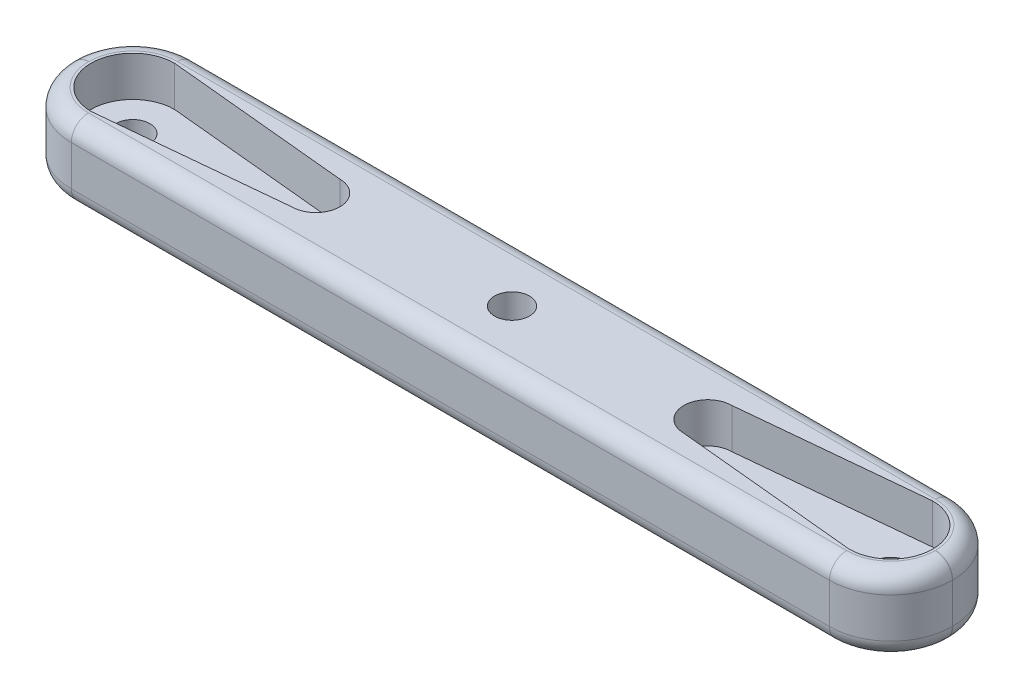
ISO-10303-21;
HEADER;
FILE_DESCRIPTION(('STEP AP214'),'2;1');
FILE_NAME('part.step','',(''),(''),'','','');
FILE_SCHEMA(('AUTOMOTIVE_DESIGN { 1 0 10303 214 1 1 1 1 }'));
ENDSEC;
DATA;
#1=APPLICATION_CONTEXT('core data for automotive mechanical design processes');
#2=APPLICATION_PROTOCOL_DEFINITION('international standard','automotive_design',2000,#1);
#3=PRODUCT_CONTEXT('',#1,'mechanical');
#4=PRODUCT('Part','Part','',(#3));
#5=PRODUCT_RELATED_PRODUCT_CATEGORY('part','',(#4));
#6=PRODUCT_DEFINITION_FORMATION('','',#4);
#7=PRODUCT_DEFINITION_CONTEXT('part definition',#1,'design');
#8=PRODUCT_DEFINITION('design','',#6,#7);
#9=PRODUCT_DEFINITION_SHAPE('','',#8);
#10=(LENGTH_UNIT() NAMED_UNIT(*) SI_UNIT(.MILLI.,.METRE.));
#11=(NAMED_UNIT(*) PLANE_ANGLE_UNIT() SI_UNIT($,.RADIAN.));
#12=(NAMED_UNIT(*) SI_UNIT($,.STERADIAN.) SOLID_ANGLE_UNIT());
#13=UNCERTAINTY_MEASURE_WITH_UNIT(LENGTH_MEASURE(1.E-05),#10,'distance_accuracy_value','');
#14=(GEOMETRIC_REPRESENTATION_CONTEXT(3) GLOBAL_UNCERTAINTY_ASSIGNED_CONTEXT((#13)) GLOBAL_UNIT_ASSIGNED_CONTEXT((#10,
#11,#12)) REPRESENTATION_CONTEXT('',''));
#15=CARTESIAN_POINT('',(0.,0.,0.));
#16=DIRECTION('',(0.,0.,1.));
#17=DIRECTION('',(1.,0.,0.));
#18=AXIS2_PLACEMENT_3D('',#15,#16,#17);
#19=CARTESIAN_POINT('',(0.,6.5,0.));
#20=DIRECTION('',(0.,-1.,0.));
#21=DIRECTION('',(0.,0.,-1.));
#22=AXIS2_PLACEMENT_3D('',#19,#20,#21);
#23=PLANE('',#22);
#24=DIRECTION('',(0.,0.,1.));
#25=VECTOR('',#24,1.);
#26=CARTESIAN_POINT('',(-37.,6.5,0.));
#27=LINE('',#26,#25);
#28=CARTESIAN_POINT('',(-37.,6.5,-0.0150000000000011));
#29=VERTEX_POINT('',#28);
#30=CARTESIAN_POINT('',(-37.,6.5,0.0150000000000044));
#31=VERTEX_POINT('',#30);
#32=EDGE_CURVE('E51',#29,#31,#27,.T.);
#33=ORIENTED_EDGE('',*,*,#32,.T.);
#34=CARTESIAN_POINT('',(-33.13,6.5,0.0150000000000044));
#35=DIRECTION('',(0.,-1.,0.));
#36=DIRECTION('',(0.,0.,-1.));
#37=AXIS2_PLACEMENT_3D('',#34,#35,#36);
#38=CIRCLE('',#37,3.87);
#39=CARTESIAN_POINT('',(-33.13,6.5,3.885));
#40=VERTEX_POINT('',#39);
#41=EDGE_CURVE('E345',#31,#40,#38,.F.);
#42=ORIENTED_EDGE('',*,*,#41,.T.);
#43=DIRECTION('',(1.,0.,0.));
#44=VECTOR('',#43,1.);
#45=CARTESIAN_POINT('',(0.,6.5,3.885));
#46=LINE('',#45,#44);
#47=CARTESIAN_POINT('',(33.13,6.5,3.885));
#48=VERTEX_POINT('',#47);
#49=EDGE_CURVE('E333',#40,#48,#46,.T.);
#50=ORIENTED_EDGE('',*,*,#49,.T.);
#51=CARTESIAN_POINT('',(33.13,6.5,0.0149999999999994));
#52=DIRECTION('',(0.,-1.,0.));
#53=DIRECTION('',(0.,0.,-1.));
#54=AXIS2_PLACEMENT_3D('',#51,#52,#53);
#55=CIRCLE('',#54,3.87);
#56=CARTESIAN_POINT('',(37.,6.5,0.0149999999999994));
#57=VERTEX_POINT('',#56);
#58=EDGE_CURVE('E335',#48,#57,#55,.F.);
#59=ORIENTED_EDGE('',*,*,#58,.T.);
#60=DIRECTION('',(0.,0.,-1.));
#61=VECTOR('',#60,1.);
#62=CARTESIAN_POINT('',(37.,6.5,0.));
#63=LINE('',#62,#61);
#64=CARTESIAN_POINT('',(37.,6.5,-0.0150000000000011));
#65=VERTEX_POINT('',#64);
#66=EDGE_CURVE('E337',#57,#65,#63,.T.);
#67=ORIENTED_EDGE('',*,*,#66,.T.);
#68=CARTESIAN_POINT('',(33.13,6.5,-0.0150000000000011));
#69=DIRECTION('',(0.,-1.,0.));
#70=DIRECTION('',(0.,0.,-1.));
#71=AXIS2_PLACEMENT_3D('',#68,#69,#70);
#72=CIRCLE('',#71,3.87);
#73=CARTESIAN_POINT('',(33.13,6.5,-3.885));
#74=VERTEX_POINT('',#73);
#75=EDGE_CURVE('E339',#65,#74,#72,.F.);
#76=ORIENTED_EDGE('',*,*,#75,.T.);
#77=DIRECTION('',(-1.,0.,0.));
#78=VECTOR('',#77,1.);
#79=CARTESIAN_POINT('',(0.,6.5,-3.885));
#80=LINE('',#79,#78);
#81=CARTESIAN_POINT('',(-33.13,6.5,-3.885));
#82=VERTEX_POINT('',#81);
#83=EDGE_CURVE('E341',#74,#82,#80,.T.);
#84=ORIENTED_EDGE('',*,*,#83,.T.);
#85=CARTESIAN_POINT('',(-33.13,6.5,-0.0150000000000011));
#86=DIRECTION('',(0.,-1.,0.));
#87=DIRECTION('',(0.,0.,-1.));
#88=AXIS2_PLACEMENT_3D('',#85,#86,#87);
#89=CIRCLE('',#88,3.87);
#90=EDGE_CURVE('E56',#82,#29,#89,.F.);
#91=ORIENTED_EDGE('',*,*,#90,.T.);
#92=EDGE_LOOP('',(#33,#42,#50,#59,#67,#76,#84,#91));
#93=FACE_BOUND('',#92,.T.);
#94=CARTESIAN_POINT('',(0.,6.5,0.));
#95=DIRECTION('',(0.,1.,0.));
#96=DIRECTION('',(0.,0.,1.));
#97=AXIS2_PLACEMENT_3D('',#94,#95,#96);
#98=CIRCLE('',#97,1.525);
#99=CARTESIAN_POINT('',(0.,6.5,1.525));
#100=VERTEX_POINT('',#99);
#101=EDGE_CURVE('E370',#100,#100,#98,.T.);
#102=ORIENTED_EDGE('',*,*,#101,.F.);
#103=EDGE_LOOP('',(#102));
#104=FACE_BOUND('',#103,.T.);
#105=CARTESIAN_POINT('',(-17.13,6.5,0.0150000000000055));
#106=DIRECTION('',(0.,1.,0.));
#107=DIRECTION('',(0.,0.,1.));
#108=AXIS2_PLACEMENT_3D('',#105,#106,#107);
#109=CIRCLE('',#108,2.1);
#110=CARTESIAN_POINT('',(-17.13,6.5,2.11500000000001));
#111=VERTEX_POINT('',#110);
#112=CARTESIAN_POINT('',(-17.13,6.5,-2.08499999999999));
#113=VERTEX_POINT('',#112);
#114=EDGE_CURVE('E223',#111,#113,#109,.T.);
#115=ORIENTED_EDGE('',*,*,#114,.F.);
#116=DIRECTION('',(-0.995340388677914,0.,0.0964236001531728));
#117=VECTOR('',#116,1.);
#118=CARTESIAN_POINT('',(0.0437192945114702,6.5,0.451295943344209));
#119=LINE('',#118,#117);
#120=CARTESIAN_POINT('',(-33.13,6.5,3.665));
#121=VERTEX_POINT('',#120);
#122=EDGE_CURVE('E214',#111,#121,#119,.T.);
#123=ORIENTED_EDGE('',*,*,#122,.T.);
#124=CARTESIAN_POINT('',(-33.13,6.5,0.0150000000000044));
#125=DIRECTION('',(0.,1.,0.));
#126=DIRECTION('',(0.,0.,1.));
#127=AXIS2_PLACEMENT_3D('',#124,#125,#126);
#128=CIRCLE('',#127,3.65);
#129=CARTESIAN_POINT('',(-33.13,6.5,-3.635));
#130=VERTEX_POINT('',#129);
#131=EDGE_CURVE('E208',#130,#121,#128,.T.);
#132=ORIENTED_EDGE('',*,*,#131,.F.);
#133=DIRECTION('',(0.995340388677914,0.,0.096423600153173));
#134=VECTOR('',#133,1.);
#135=CARTESIAN_POINT('',(0.0408400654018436,6.5,-0.421574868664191));
#136=LINE('',#135,#134);
#137=EDGE_CURVE('E261',#130,#113,#136,.T.);
#138=ORIENTED_EDGE('',*,*,#137,.T.);
#139=EDGE_LOOP('',(#115,#123,#132,#138));
#140=FACE_BOUND('',#139,.T.);
#141=CARTESIAN_POINT('',(17.13,6.5,0.0150000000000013));
#142=DIRECTION('',(0.,1.,0.));
#143=DIRECTION('',(0.,0.,1.));
#144=AXIS2_PLACEMENT_3D('',#141,#142,#143);
#145=CIRCLE('',#144,2.1);
#146=CARTESIAN_POINT('',(17.13,6.5,-2.085));
#147=VERTEX_POINT('',#146);
#148=CARTESIAN_POINT('',(17.13,6.5,2.115));
#149=VERTEX_POINT('',#148);
#150=EDGE_CURVE('E237',#147,#149,#145,.T.);
#151=ORIENTED_EDGE('',*,*,#150,.F.);
#152=DIRECTION('',(0.995340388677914,0.,-0.0964236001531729));
#153=VECTOR('',#152,1.);
#154=CARTESIAN_POINT('',(-0.0408400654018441,6.5,-0.421574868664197));
#155=LINE('',#154,#153);
#156=CARTESIAN_POINT('',(33.13,6.5,-3.635));
#157=VERTEX_POINT('',#156);
#158=EDGE_CURVE('E255',#147,#157,#155,.T.);
#159=ORIENTED_EDGE('',*,*,#158,.T.);
#160=CARTESIAN_POINT('',(33.13,6.5,0.0149999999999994));
#161=DIRECTION('',(0.,1.,0.));
#162=DIRECTION('',(0.,0.,1.));
#163=AXIS2_PLACEMENT_3D('',#160,#161,#162);
#164=CIRCLE('',#163,3.65);
#165=CARTESIAN_POINT('',(33.13,6.5,3.665));
#166=VERTEX_POINT('',#165);
#167=EDGE_CURVE('E273',#166,#157,#164,.T.);
#168=ORIENTED_EDGE('',*,*,#167,.F.);
#169=DIRECTION('',(-0.995340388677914,0.,-0.0964236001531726));
#170=VECTOR('',#169,1.);
#171=CARTESIAN_POINT('',(-0.0437192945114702,6.5,0.45129594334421));
#172=LINE('',#171,#170);
#173=EDGE_CURVE('E281',#166,#149,#172,.T.);
#174=ORIENTED_EDGE('',*,*,#173,.T.);
#175=EDGE_LOOP('',(#151,#159,#168,#174));
#176=FACE_BOUND('',#175,.T.);
#177=ADVANCED_FACE('F34',(#93,#104,#140,#176),#23,.F.);
#178=CARTESIAN_POINT('',(-38.5,6.5,-5.385));
#179=DIRECTION('',(0.,0.,1.));
#180=DIRECTION('',(1.,0.,0.));
#181=AXIS2_PLACEMENT_3D('',#178,#179,#180);
#182=PLANE('',#181);
#183=DIRECTION('',(0.,1.,0.));
#184=VECTOR('',#183,1.);
#185=CARTESIAN_POINT('',(33.13,0.,-5.385));
#186=LINE('',#185,#184);
#187=CARTESIAN_POINT('',(33.13,1.5,-5.385));
#188=VERTEX_POINT('',#187);
#189=CARTESIAN_POINT('',(33.13,5.,-5.385));
#190=VERTEX_POINT('',#189);
#191=EDGE_CURVE('E410',#188,#190,#186,.T.);
#192=ORIENTED_EDGE('',*,*,#191,.F.);
#193=DIRECTION('',(-1.,0.,0.));
#194=VECTOR('',#193,1.);
#195=CARTESIAN_POINT('',(-33.13,1.5,-5.385));
#196=LINE('',#195,#194);
#197=CARTESIAN_POINT('',(-33.13,1.5,-5.385));
#198=VERTEX_POINT('',#197);
#199=EDGE_CURVE('E319',#188,#198,#196,.T.);
#200=ORIENTED_EDGE('',*,*,#199,.T.);
#201=DIRECTION('',(0.,1.,0.));
#202=VECTOR('',#201,1.);
#203=CARTESIAN_POINT('',(-33.13,0.,-5.385));
#204=LINE('',#203,#202);
#205=CARTESIAN_POINT('',(-33.13,5.,-5.385));
#206=VERTEX_POINT('',#205);
#207=EDGE_CURVE('E228',#198,#206,#204,.T.);
#208=ORIENTED_EDGE('',*,*,#207,.T.);
#209=DIRECTION('',(-1.,0.,0.));
#210=VECTOR('',#209,1.);
#211=CARTESIAN_POINT('',(-38.5,5.,-5.385));
#212=LINE('',#211,#210);
#213=EDGE_CURVE('E317',#206,#190,#212,.F.);
#214=ORIENTED_EDGE('',*,*,#213,.T.);
#215=EDGE_LOOP('',(#192,#200,#208,#214));
#216=FACE_BOUND('',#215,.T.);
#217=ADVANCED_FACE('F510',(#216),#182,.F.);
#218=CARTESIAN_POINT('',(-38.5,6.5,5.385));
#219=DIRECTION('',(1.,0.,0.));
#220=DIRECTION('',(0.,0.,-1.));
#221=AXIS2_PLACEMENT_3D('',#218,#219,#220);
#222=PLANE('',#221);
#223=DIRECTION('',(0.,1.,0.));
#224=VECTOR('',#223,1.);
#225=CARTESIAN_POINT('',(-38.5,0.,-0.0150000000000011));
#226=LINE('',#225,#224);
#227=CARTESIAN_POINT('',(-38.5,1.5,-0.0150000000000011));
#228=VERTEX_POINT('',#227);
#229=CARTESIAN_POINT('',(-38.5,5.,-0.0150000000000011));
#230=VERTEX_POINT('',#229);
#231=EDGE_CURVE('E240',#228,#230,#226,.T.);
#232=ORIENTED_EDGE('',*,*,#231,.F.);
#233=DIRECTION('',(0.,0.,1.));
#234=VECTOR('',#233,1.);
#235=CARTESIAN_POINT('',(-38.5,1.5,0.0150000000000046));
#236=LINE('',#235,#234);
#237=CARTESIAN_POINT('',(-38.5,1.5,0.0150000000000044));
#238=VERTEX_POINT('',#237);
#239=EDGE_CURVE('E311',#228,#238,#236,.T.);
#240=ORIENTED_EDGE('',*,*,#239,.T.);
#241=DIRECTION('',(0.,1.,0.));
#242=VECTOR('',#241,1.);
#243=CARTESIAN_POINT('',(-38.5,0.,0.0150000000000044));
#244=LINE('',#243,#242);
#245=CARTESIAN_POINT('',(-38.5,5.,0.0150000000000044));
#246=VERTEX_POINT('',#245);
#247=EDGE_CURVE('E432',#238,#246,#244,.T.);
#248=ORIENTED_EDGE('',*,*,#247,.T.);
#249=DIRECTION('',(0.,0.,1.));
#250=VECTOR('',#249,1.);
#251=CARTESIAN_POINT('',(-38.5,5.,5.385));
#252=LINE('',#251,#250);
#253=EDGE_CURVE('E309',#246,#230,#252,.F.);
#254=ORIENTED_EDGE('',*,*,#253,.T.);
#255=EDGE_LOOP('',(#232,#240,#248,#254));
#256=FACE_BOUND('',#255,.T.);
#257=ADVANCED_FACE('F515',(#256),#222,.F.);
#258=CARTESIAN_POINT('',(-38.5,6.5,5.385));
#259=DIRECTION('',(0.,0.,-1.));
#260=DIRECTION('',(-1.,0.,0.));
#261=AXIS2_PLACEMENT_3D('',#258,#259,#260);
#262=PLANE('',#261);
#263=DIRECTION('',(0.,1.,0.));
#264=VECTOR('',#263,1.);
#265=CARTESIAN_POINT('',(-33.13,0.,5.385));
#266=LINE('',#265,#264);
#267=CARTESIAN_POINT('',(-33.13,1.5,5.385));
#268=VERTEX_POINT('',#267);
#269=CARTESIAN_POINT('',(-33.13,5.,5.385));
#270=VERTEX_POINT('',#269);
#271=EDGE_CURVE('E428',#268,#270,#266,.T.);
#272=ORIENTED_EDGE('',*,*,#271,.F.);
#273=DIRECTION('',(1.,0.,0.));
#274=VECTOR('',#273,1.);
#275=CARTESIAN_POINT('',(33.13,1.5,5.385));
#276=LINE('',#275,#274);
#277=CARTESIAN_POINT('',(33.13,1.5,5.385));
#278=VERTEX_POINT('',#277);
#279=EDGE_CURVE('E11',#268,#278,#276,.T.);
#280=ORIENTED_EDGE('',*,*,#279,.T.);
#281=DIRECTION('',(0.,1.,0.));
#282=VECTOR('',#281,1.);
#283=CARTESIAN_POINT('',(33.13,0.,5.385));
#284=LINE('',#283,#282);
#285=CARTESIAN_POINT('',(33.13,5.,5.385));
#286=VERTEX_POINT('',#285);
#287=EDGE_CURVE('E438',#278,#286,#284,.T.);
#288=ORIENTED_EDGE('',*,*,#287,.T.);
#289=DIRECTION('',(1.,0.,0.));
#290=VECTOR('',#289,1.);
#291=CARTESIAN_POINT('',(-38.5,5.,5.385));
#292=LINE('',#291,#290);
#293=EDGE_CURVE('E43',#286,#270,#292,.F.);
#294=ORIENTED_EDGE('',*,*,#293,.T.);
#295=EDGE_LOOP('',(#272,#280,#288,#294));
#296=FACE_BOUND('',#295,.T.);
#297=ADVANCED_FACE('F460',(#296),#262,.F.);
#298=CARTESIAN_POINT('',(0.,0.,0.));
#299=DIRECTION('',(0.,-1.,0.));
#300=DIRECTION('',(0.,0.,-1.));
#301=AXIS2_PLACEMENT_3D('',#298,#299,#300);
#302=PLANE('',#301);
#303=DIRECTION('',(1.,0.,0.));
#304=VECTOR('',#303,1.);
#305=CARTESIAN_POINT('',(-33.13,0.,3.885));
#306=LINE('',#305,#304);
#307=CARTESIAN_POINT('',(33.13,0.,3.885));
#308=VERTEX_POINT('',#307);
#309=CARTESIAN_POINT('',(-33.13,0.,3.885));
#310=VERTEX_POINT('',#309);
#311=EDGE_CURVE('E292',#308,#310,#306,.F.);
#312=ORIENTED_EDGE('',*,*,#311,.T.);
#313=CARTESIAN_POINT('',(-33.13,0.,0.0150000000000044));
#314=DIRECTION('',(0.,-1.,0.));
#315=DIRECTION('',(0.,0.,-1.));
#316=AXIS2_PLACEMENT_3D('',#313,#314,#315);
#317=CIRCLE('',#316,3.87);
#318=CARTESIAN_POINT('',(-37.,0.,0.0150000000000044));
#319=VERTEX_POINT('',#318);
#320=EDGE_CURVE('E306',#310,#319,#317,.T.);
#321=ORIENTED_EDGE('',*,*,#320,.T.);
#322=DIRECTION('',(0.,0.,1.));
#323=VECTOR('',#322,1.);
#324=CARTESIAN_POINT('',(-37.,0.,-0.0150000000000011));
#325=LINE('',#324,#323);
#326=CARTESIAN_POINT('',(-37.,0.,-0.0150000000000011));
#327=VERTEX_POINT('',#326);
#328=EDGE_CURVE('E304',#319,#327,#325,.F.);
#329=ORIENTED_EDGE('',*,*,#328,.T.);
#330=CARTESIAN_POINT('',(-33.13,0.,-0.0150000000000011));
#331=DIRECTION('',(0.,-1.,0.));
#332=DIRECTION('',(0.,0.,-1.));
#333=AXIS2_PLACEMENT_3D('',#330,#331,#332);
#334=CIRCLE('',#333,3.87);
#335=CARTESIAN_POINT('',(-33.13,0.,-3.885));
#336=VERTEX_POINT('',#335);
#337=EDGE_CURVE('E302',#327,#336,#334,.T.);
#338=ORIENTED_EDGE('',*,*,#337,.T.);
#339=DIRECTION('',(-1.,0.,0.));
#340=VECTOR('',#339,1.);
#341=CARTESIAN_POINT('',(33.13,0.,-3.885));
#342=LINE('',#341,#340);
#343=CARTESIAN_POINT('',(33.13,0.,-3.885));
#344=VERTEX_POINT('',#343);
#345=EDGE_CURVE('E300',#336,#344,#342,.F.);
#346=ORIENTED_EDGE('',*,*,#345,.T.);
#347=CARTESIAN_POINT('',(33.13,0.,-0.0150000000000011));
#348=DIRECTION('',(0.,-1.,0.));
#349=DIRECTION('',(0.,0.,-1.));
#350=AXIS2_PLACEMENT_3D('',#347,#348,#349);
#351=CIRCLE('',#350,3.87);
#352=CARTESIAN_POINT('',(37.,0.,-0.0150000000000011));
#353=VERTEX_POINT('',#352);
#354=EDGE_CURVE('E298',#344,#353,#351,.T.);
#355=ORIENTED_EDGE('',*,*,#354,.T.);
#356=DIRECTION('',(0.,0.,-1.));
#357=VECTOR('',#356,1.);
#358=CARTESIAN_POINT('',(37.,0.,0.0149999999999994));
#359=LINE('',#358,#357);
#360=CARTESIAN_POINT('',(37.,0.,0.0149999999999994));
#361=VERTEX_POINT('',#360);
#362=EDGE_CURVE('E296',#353,#361,#359,.F.);
#363=ORIENTED_EDGE('',*,*,#362,.T.);
#364=CARTESIAN_POINT('',(33.13,0.,0.0149999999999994));
#365=DIRECTION('',(0.,-1.,0.));
#366=DIRECTION('',(0.,0.,-1.));
#367=AXIS2_PLACEMENT_3D('',#364,#365,#366);
#368=CIRCLE('',#367,3.87);
#369=EDGE_CURVE('E294',#361,#308,#368,.T.);
#370=ORIENTED_EDGE('',*,*,#369,.T.);
#371=EDGE_LOOP('',(#312,#321,#329,#338,#346,#355,#363,#370));
#372=FACE_BOUND('',#371,.T.);
#373=CARTESIAN_POINT('',(0.,0.,0.));
#374=DIRECTION('',(0.,1.,0.));
#375=DIRECTION('',(0.,0.,1.));
#376=AXIS2_PLACEMENT_3D('',#373,#374,#375);
#377=CIRCLE('',#376,1.525);
#378=CARTESIAN_POINT('',(0.,0.,1.525));
#379=VERTEX_POINT('',#378);
#380=EDGE_CURVE('E416',#379,#379,#377,.T.);
#381=ORIENTED_EDGE('',*,*,#380,.T.);
#382=EDGE_LOOP('',(#381));
#383=FACE_BOUND('',#382,.T.);
#384=CARTESIAN_POINT('',(-33.13,0.,0.0150000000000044));
#385=DIRECTION('',(0.,1.,0.));
#386=DIRECTION('',(0.,0.,1.));
#387=AXIS2_PLACEMENT_3D('',#384,#385,#386);
#388=CIRCLE('',#387,1.5);
#389=CARTESIAN_POINT('',(-33.13,0.,1.51500000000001));
#390=VERTEX_POINT('',#389);
#391=EDGE_CURVE('E245',#390,#390,#388,.T.);
#392=ORIENTED_EDGE('',*,*,#391,.T.);
#393=EDGE_LOOP('',(#392));
#394=FACE_BOUND('',#393,.T.);
#395=CARTESIAN_POINT('',(33.13,0.,0.0149999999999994));
#396=DIRECTION('',(0.,1.,0.));
#397=DIRECTION('',(0.,0.,1.));
#398=AXIS2_PLACEMENT_3D('',#395,#396,#397);
#399=CIRCLE('',#398,1.5);
#400=CARTESIAN_POINT('',(33.13,0.,1.515));
#401=VERTEX_POINT('',#400);
#402=EDGE_CURVE('E231',#401,#401,#399,.T.);
#403=ORIENTED_EDGE('',*,*,#402,.T.);
#404=EDGE_LOOP('',(#403));
#405=FACE_BOUND('',#404,.T.);
#406=ADVANCED_FACE('F473',(#372,#383,#394,#405),#302,.T.);
#407=CARTESIAN_POINT('',(38.5,6.5,5.385));
#408=DIRECTION('',(-1.,0.,0.));
#409=DIRECTION('',(0.,0.,1.));
#410=AXIS2_PLACEMENT_3D('',#407,#408,#409);
#411=PLANE('',#410);
#412=DIRECTION('',(0.,1.,0.));
#413=VECTOR('',#412,1.);
#414=CARTESIAN_POINT('',(38.5,0.,0.0149999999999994));
#415=LINE('',#414,#413);
#416=CARTESIAN_POINT('',(38.5,1.5,0.0149999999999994));
#417=VERTEX_POINT('',#416);
#418=CARTESIAN_POINT('',(38.5,5.,0.0149999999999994));
#419=VERTEX_POINT('',#418);
#420=EDGE_CURVE('E418',#417,#419,#415,.T.);
#421=ORIENTED_EDGE('',*,*,#420,.F.);
#422=DIRECTION('',(0.,0.,-1.));
#423=VECTOR('',#422,1.);
#424=CARTESIAN_POINT('',(38.5,1.5,-0.0150000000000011));
#425=LINE('',#424,#423);
#426=CARTESIAN_POINT('',(38.5,1.5,-0.0150000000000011));
#427=VERTEX_POINT('',#426);
#428=EDGE_CURVE('E327',#417,#427,#425,.T.);
#429=ORIENTED_EDGE('',*,*,#428,.T.);
#430=DIRECTION('',(0.,1.,0.));
#431=VECTOR('',#430,1.);
#432=CARTESIAN_POINT('',(38.5,0.,-0.0150000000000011));
#433=LINE('',#432,#431);
#434=CARTESIAN_POINT('',(38.5,5.,-0.0150000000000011));
#435=VERTEX_POINT('',#434);
#436=EDGE_CURVE('E407',#427,#435,#433,.T.);
#437=ORIENTED_EDGE('',*,*,#436,.T.);
#438=DIRECTION('',(0.,0.,-1.));
#439=VECTOR('',#438,1.);
#440=CARTESIAN_POINT('',(38.5,5.,5.385));
#441=LINE('',#440,#439);
#442=EDGE_CURVE('E325',#435,#419,#441,.F.);
#443=ORIENTED_EDGE('',*,*,#442,.T.);
#444=EDGE_LOOP('',(#421,#429,#437,#443));
#445=FACE_BOUND('',#444,.T.);
#446=ADVANCED_FACE('F413',(#445),#411,.F.);
#447=CARTESIAN_POINT('',(-0.0408400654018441,3.,-0.421574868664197));
#448=DIRECTION('',(0.0964236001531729,0.,0.995340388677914));
#449=DIRECTION('',(0.995340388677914,0.,-0.0964236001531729));
#450=AXIS2_PLACEMENT_3D('',#447,#448,#449);
#451=PLANE('',#450);
#452=ORIENTED_EDGE('',*,*,#158,.F.);
#453=DIRECTION('',(0.,1.,0.));
#454=VECTOR('',#453,1.);
#455=CARTESIAN_POINT('',(17.13,3.,-2.085));
#456=LINE('',#455,#454);
#457=CARTESIAN_POINT('',(17.13,3.,-2.085));
#458=VERTEX_POINT('',#457);
#459=EDGE_CURVE('E225',#458,#147,#456,.T.);
#460=ORIENTED_EDGE('',*,*,#459,.F.);
#461=DIRECTION('',(0.995340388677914,0.,-0.0964236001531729));
#462=VECTOR('',#461,1.);
#463=CARTESIAN_POINT('',(-0.0408400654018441,3.,-0.421574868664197));
#464=LINE('',#463,#462);
#465=CARTESIAN_POINT('',(33.13,3.,-3.635));
#466=VERTEX_POINT('',#465);
#467=EDGE_CURVE('E270',#458,#466,#464,.T.);
#468=ORIENTED_EDGE('',*,*,#467,.T.);
#469=DIRECTION('',(0.,1.,0.));
#470=VECTOR('',#469,1.);
#471=CARTESIAN_POINT('',(33.13,3.,-3.635));
#472=LINE('',#471,#470);
#473=EDGE_CURVE('E262',#466,#157,#472,.T.);
#474=ORIENTED_EDGE('',*,*,#473,.T.);
#475=EDGE_LOOP('',(#452,#460,#468,#474));
#476=FACE_BOUND('',#475,.T.);
#477=ADVANCED_FACE('F520',(#476),#451,.T.);
#478=CARTESIAN_POINT('',(33.13,3.,0.0149999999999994));
#479=DIRECTION('',(0.,1.,0.));
#480=DIRECTION('',(0.,0.,1.));
#481=AXIS2_PLACEMENT_3D('',#478,#479,#480);
#482=CYLINDRICAL_SURFACE('',#481,3.65);
#483=ORIENTED_EDGE('',*,*,#167,.T.);
#484=ORIENTED_EDGE('',*,*,#473,.F.);
#485=CARTESIAN_POINT('',(33.13,3.,0.0149999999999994));
#486=DIRECTION('',(0.,1.,0.));
#487=DIRECTION('',(0.,0.,1.));
#488=AXIS2_PLACEMENT_3D('',#485,#486,#487);
#489=CIRCLE('',#488,3.65);
#490=CARTESIAN_POINT('',(33.13,3.,3.665));
#491=VERTEX_POINT('',#490);
#492=EDGE_CURVE('E274',#491,#466,#489,.T.);
#493=ORIENTED_EDGE('',*,*,#492,.F.);
#494=DIRECTION('',(0.,1.,0.));
#495=VECTOR('',#494,1.);
#496=CARTESIAN_POINT('',(33.13,3.,3.665));
#497=LINE('',#496,#495);
#498=EDGE_CURVE('E277',#491,#166,#497,.T.);
#499=ORIENTED_EDGE('',*,*,#498,.T.);
#500=EDGE_LOOP('',(#483,#484,#493,#499));
#501=FACE_BOUND('',#500,.T.);
#502=ADVANCED_FACE('F789',(#501),#482,.F.);
#503=CARTESIAN_POINT('',(-0.0437192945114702,3.,0.45129594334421));
#504=DIRECTION('',(0.0964236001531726,0.,-0.995340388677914));
#505=DIRECTION('',(-0.995340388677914,0.,-0.0964236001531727));
#506=AXIS2_PLACEMENT_3D('',#503,#504,#505);
#507=PLANE('',#506);
#508=ORIENTED_EDGE('',*,*,#173,.F.);
#509=ORIENTED_EDGE('',*,*,#498,.F.);
#510=DIRECTION('',(-0.995340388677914,0.,-0.0964236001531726));
#511=VECTOR('',#510,1.);
#512=CARTESIAN_POINT('',(-0.0437192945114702,3.,0.45129594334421));
#513=LINE('',#512,#511);
#514=CARTESIAN_POINT('',(17.13,3.,2.115));
#515=VERTEX_POINT('',#514);
#516=EDGE_CURVE('E272',#491,#515,#513,.T.);
#517=ORIENTED_EDGE('',*,*,#516,.T.);
#518=DIRECTION('',(0.,1.,0.));
#519=VECTOR('',#518,1.);
#520=CARTESIAN_POINT('',(17.13,3.,2.115));
#521=LINE('',#520,#519);
#522=EDGE_CURVE('E236',#515,#149,#521,.T.);
#523=ORIENTED_EDGE('',*,*,#522,.T.);
#524=EDGE_LOOP('',(#508,#509,#517,#523));
#525=FACE_BOUND('',#524,.T.);
#526=ADVANCED_FACE('F777',(#525),#507,.T.);
#527=CARTESIAN_POINT('',(0.,3.,0.));
#528=DIRECTION('',(0.,1.,0.));
#529=DIRECTION('',(0.,0.,1.));
#530=AXIS2_PLACEMENT_3D('',#527,#528,#529);
#531=PLANE('',#530);
#532=ORIENTED_EDGE('',*,*,#467,.F.);
#533=CARTESIAN_POINT('',(17.13,3.,0.0150000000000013));
#534=DIRECTION('',(0.,1.,0.));
#535=DIRECTION('',(0.,0.,1.));
#536=AXIS2_PLACEMENT_3D('',#533,#534,#535);
#537=CIRCLE('',#536,2.1);
#538=EDGE_CURVE('E233',#458,#515,#537,.T.);
#539=ORIENTED_EDGE('',*,*,#538,.T.);
#540=ORIENTED_EDGE('',*,*,#516,.F.);
#541=ORIENTED_EDGE('',*,*,#492,.T.);
#542=EDGE_LOOP('',(#532,#539,#540,#541));
#543=FACE_BOUND('',#542,.T.);
#544=CARTESIAN_POINT('',(33.13,3.,0.0149999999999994));
#545=DIRECTION('',(0.,1.,0.));
#546=DIRECTION('',(0.,0.,1.));
#547=AXIS2_PLACEMENT_3D('',#544,#545,#546);
#548=CIRCLE('',#547,1.5);
#549=CARTESIAN_POINT('',(33.13,3.,1.515));
#550=VERTEX_POINT('',#549);
#551=EDGE_CURVE('E253',#550,#550,#548,.T.);
#552=ORIENTED_EDGE('',*,*,#551,.F.);
#553=EDGE_LOOP('',(#552));
#554=FACE_BOUND('',#553,.T.);
#555=ADVANCED_FACE('F766',(#543,#554),#531,.T.);
#556=CARTESIAN_POINT('',(0.0437192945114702,3.,0.451295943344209));
#557=DIRECTION('',(-0.0964236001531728,0.,-0.995340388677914));
#558=DIRECTION('',(-0.995340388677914,0.,0.0964236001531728));
#559=AXIS2_PLACEMENT_3D('',#556,#557,#558);
#560=PLANE('',#559);
#561=ORIENTED_EDGE('',*,*,#122,.F.);
#562=DIRECTION('',(0.,1.,0.));
#563=VECTOR('',#562,1.);
#564=CARTESIAN_POINT('',(-17.13,3.,2.11500000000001));
#565=LINE('',#564,#563);
#566=CARTESIAN_POINT('',(-17.13,3.,2.11500000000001));
#567=VERTEX_POINT('',#566);
#568=EDGE_CURVE('E211',#567,#111,#565,.T.);
#569=ORIENTED_EDGE('',*,*,#568,.F.);
#570=DIRECTION('',(-0.995340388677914,0.,0.0964236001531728));
#571=VECTOR('',#570,1.);
#572=CARTESIAN_POINT('',(0.0437192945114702,3.,0.451295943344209));
#573=LINE('',#572,#571);
#574=CARTESIAN_POINT('',(-33.13,3.,3.665));
#575=VERTEX_POINT('',#574);
#576=EDGE_CURVE('E196',#567,#575,#573,.T.);
#577=ORIENTED_EDGE('',*,*,#576,.T.);
#578=DIRECTION('',(0.,1.,0.));
#579=VECTOR('',#578,1.);
#580=CARTESIAN_POINT('',(-33.13,3.,3.665));
#581=LINE('',#580,#579);
#582=EDGE_CURVE('E266',#575,#121,#581,.T.);
#583=ORIENTED_EDGE('',*,*,#582,.T.);
#584=EDGE_LOOP('',(#561,#569,#577,#583));
#585=FACE_BOUND('',#584,.T.);
#586=ADVANCED_FACE('F212',(#585),#560,.T.);
#587=CARTESIAN_POINT('',(-33.13,3.,0.0150000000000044));
#588=DIRECTION('',(0.,1.,0.));
#589=DIRECTION('',(0.,0.,1.));
#590=AXIS2_PLACEMENT_3D('',#587,#588,#589);
#591=CYLINDRICAL_SURFACE('',#590,3.65);
#592=ORIENTED_EDGE('',*,*,#131,.T.);
#593=ORIENTED_EDGE('',*,*,#582,.F.);
#594=CARTESIAN_POINT('',(-33.13,3.,0.0150000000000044));
#595=DIRECTION('',(0.,1.,0.));
#596=DIRECTION('',(0.,0.,1.));
#597=AXIS2_PLACEMENT_3D('',#594,#595,#596);
#598=CIRCLE('',#597,3.65);
#599=CARTESIAN_POINT('',(-33.13,3.,-3.635));
#600=VERTEX_POINT('',#599);
#601=EDGE_CURVE('E204',#600,#575,#598,.T.);
#602=ORIENTED_EDGE('',*,*,#601,.F.);
#603=DIRECTION('',(0.,1.,0.));
#604=VECTOR('',#603,1.);
#605=CARTESIAN_POINT('',(-33.13,3.,-3.635));
#606=LINE('',#605,#604);
#607=EDGE_CURVE('E258',#600,#130,#606,.T.);
#608=ORIENTED_EDGE('',*,*,#607,.T.);
#609=EDGE_LOOP('',(#592,#593,#602,#608));
#610=FACE_BOUND('',#609,.T.);
#611=ADVANCED_FACE('F753',(#610),#591,.F.);
#612=CARTESIAN_POINT('',(0.0408400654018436,3.,-0.421574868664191));
#613=DIRECTION('',(-0.0964236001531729,0.,0.995340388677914));
#614=DIRECTION('',(0.995340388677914,0.,0.0964236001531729));
#615=AXIS2_PLACEMENT_3D('',#612,#613,#614);
#616=PLANE('',#615);
#617=ORIENTED_EDGE('',*,*,#137,.F.);
#618=ORIENTED_EDGE('',*,*,#607,.F.);
#619=DIRECTION('',(0.995340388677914,0.,0.096423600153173));
#620=VECTOR('',#619,1.);
#621=CARTESIAN_POINT('',(0.0408400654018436,3.,-0.421574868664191));
#622=LINE('',#621,#620);
#623=CARTESIAN_POINT('',(-17.13,3.,-2.08499999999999));
#624=VERTEX_POINT('',#623);
#625=EDGE_CURVE('E207',#600,#624,#622,.T.);
#626=ORIENTED_EDGE('',*,*,#625,.T.);
#627=DIRECTION('',(0.,1.,0.));
#628=VECTOR('',#627,1.);
#629=CARTESIAN_POINT('',(-17.13,3.,-2.08499999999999));
#630=LINE('',#629,#628);
#631=EDGE_CURVE('E218',#624,#113,#630,.T.);
#632=ORIENTED_EDGE('',*,*,#631,.T.);
#633=EDGE_LOOP('',(#617,#618,#626,#632));
#634=FACE_BOUND('',#633,.T.);
#635=ADVANCED_FACE('F741',(#634),#616,.T.);
#636=CARTESIAN_POINT('',(0.,3.,0.));
#637=DIRECTION('',(0.,1.,0.));
#638=DIRECTION('',(0.,0.,1.));
#639=AXIS2_PLACEMENT_3D('',#636,#637,#638);
#640=PLANE('',#639);
#641=ORIENTED_EDGE('',*,*,#576,.F.);
#642=CARTESIAN_POINT('',(-17.13,3.,0.0150000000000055));
#643=DIRECTION('',(0.,1.,0.));
#644=DIRECTION('',(0.,0.,1.));
#645=AXIS2_PLACEMENT_3D('',#642,#643,#644);
#646=CIRCLE('',#645,2.1);
#647=EDGE_CURVE('E202',#567,#624,#646,.T.);
#648=ORIENTED_EDGE('',*,*,#647,.T.);
#649=ORIENTED_EDGE('',*,*,#625,.F.);
#650=ORIENTED_EDGE('',*,*,#601,.T.);
#651=EDGE_LOOP('',(#641,#648,#649,#650));
#652=FACE_BOUND('',#651,.T.);
#653=CARTESIAN_POINT('',(-33.13,3.,0.0150000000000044));
#654=DIRECTION('',(0.,1.,0.));
#655=DIRECTION('',(0.,0.,1.));
#656=AXIS2_PLACEMENT_3D('',#653,#654,#655);
#657=CIRCLE('',#656,1.5);
#658=CARTESIAN_POINT('',(-33.13,3.,1.51500000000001));
#659=VERTEX_POINT('',#658);
#660=EDGE_CURVE('E248',#659,#659,#657,.T.);
#661=ORIENTED_EDGE('',*,*,#660,.F.);
#662=EDGE_LOOP('',(#661));
#663=FACE_BOUND('',#662,.T.);
#664=ADVANCED_FACE('F198',(#652,#663),#640,.T.);
#665=CARTESIAN_POINT('',(-33.13,0.,0.0150000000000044));
#666=DIRECTION('',(0.,1.,0.));
#667=DIRECTION('',(0.,0.,1.));
#668=AXIS2_PLACEMENT_3D('',#665,#666,#667);
#669=CYLINDRICAL_SURFACE('',#668,1.5);
#670=CARTESIAN_POINT('',(-33.13,3.,1.51500000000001));
#671=CARTESIAN_POINT('',(-33.13,2.96875,1.51500000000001));
#672=CARTESIAN_POINT('',(-33.13,2.9375,1.51500000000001));
#673=CARTESIAN_POINT('',(-33.13,2.875,1.51500000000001));
#674=CARTESIAN_POINT('',(-33.13,2.84375,1.51500000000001));
#675=CARTESIAN_POINT('',(-33.13,2.78125,1.51500000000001));
#676=CARTESIAN_POINT('',(-33.13,2.75,1.51500000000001));
#677=CARTESIAN_POINT('',(-33.13,2.6875,1.51500000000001));
#678=CARTESIAN_POINT('',(-33.13,2.65625,1.51500000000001));
#679=CARTESIAN_POINT('',(-33.13,2.59375,1.51500000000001));
#680=CARTESIAN_POINT('',(-33.13,2.5625,1.51500000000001));
#681=CARTESIAN_POINT('',(-33.13,2.5,1.51500000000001));
#682=CARTESIAN_POINT('',(-33.13,2.46875,1.51500000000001));
#683=CARTESIAN_POINT('',(-33.13,2.40625,1.51500000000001));
#684=CARTESIAN_POINT('',(-33.13,2.375,1.51500000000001));
#685=CARTESIAN_POINT('',(-33.13,2.3125,1.51500000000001));
#686=CARTESIAN_POINT('',(-33.13,2.28125,1.51500000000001));
#687=CARTESIAN_POINT('',(-33.13,2.21875,1.51500000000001));
#688=CARTESIAN_POINT('',(-33.13,2.1875,1.51500000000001));
#689=CARTESIAN_POINT('',(-33.13,2.125,1.51500000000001));
#690=CARTESIAN_POINT('',(-33.13,2.09375,1.51500000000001));
#691=CARTESIAN_POINT('',(-33.13,2.03125,1.51500000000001));
#692=CARTESIAN_POINT('',(-33.13,2.,1.51500000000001));
#693=CARTESIAN_POINT('',(-33.13,1.9375,1.51500000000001));
#694=CARTESIAN_POINT('',(-33.13,1.90625,1.51500000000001));
#695=CARTESIAN_POINT('',(-33.13,1.84375,1.51500000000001));
#696=CARTESIAN_POINT('',(-33.13,1.8125,1.51500000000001));
#697=CARTESIAN_POINT('',(-33.13,1.75,1.51500000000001));
#698=CARTESIAN_POINT('',(-33.13,1.71875,1.51500000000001));
#699=CARTESIAN_POINT('',(-33.13,1.65625,1.51500000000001));
#700=CARTESIAN_POINT('',(-33.13,1.625,1.51500000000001));
#701=CARTESIAN_POINT('',(-33.13,1.5625,1.51500000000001));
#702=CARTESIAN_POINT('',(-33.13,1.53125,1.51500000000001));
#703=CARTESIAN_POINT('',(-33.13,1.46875,1.51500000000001));
#704=CARTESIAN_POINT('',(-33.13,1.4375,1.51500000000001));
#705=CARTESIAN_POINT('',(-33.13,1.375,1.51500000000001));
#706=CARTESIAN_POINT('',(-33.13,1.34375,1.51500000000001));
#707=CARTESIAN_POINT('',(-33.13,1.28125,1.51500000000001));
#708=CARTESIAN_POINT('',(-33.13,1.25,1.51500000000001));
#709=CARTESIAN_POINT('',(-33.13,1.1875,1.51500000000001));
#710=CARTESIAN_POINT('',(-33.13,1.15625,1.51500000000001));
#711=CARTESIAN_POINT('',(-33.13,1.09375,1.51500000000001));
#712=CARTESIAN_POINT('',(-33.13,1.0625,1.51500000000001));
#713=CARTESIAN_POINT('',(-33.13,1.,1.51500000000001));
#714=CARTESIAN_POINT('',(-33.13,0.96875,1.51500000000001));
#715=CARTESIAN_POINT('',(-33.13,0.90625,1.51500000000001));
#716=CARTESIAN_POINT('',(-33.13,0.875,1.51500000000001));
#717=CARTESIAN_POINT('',(-33.13,0.8125,1.51500000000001));
#718=CARTESIAN_POINT('',(-33.13,0.78125,1.51500000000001));
#719=CARTESIAN_POINT('',(-33.13,0.71875,1.51500000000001));
#720=CARTESIAN_POINT('',(-33.13,0.6875,1.51500000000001));
#721=CARTESIAN_POINT('',(-33.13,0.625,1.51500000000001));
#722=CARTESIAN_POINT('',(-33.13,0.59375,1.51500000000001));
#723=CARTESIAN_POINT('',(-33.13,0.53125,1.51500000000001));
#724=CARTESIAN_POINT('',(-33.13,0.5,1.51500000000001));
#725=CARTESIAN_POINT('',(-33.13,0.4375,1.51500000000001));
#726=CARTESIAN_POINT('',(-33.13,0.40625,1.51500000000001));
#727=CARTESIAN_POINT('',(-33.13,0.34375,1.51500000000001));
#728=CARTESIAN_POINT('',(-33.13,0.3125,1.51500000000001));
#729=CARTESIAN_POINT('',(-33.13,0.25,1.51500000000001));
#730=CARTESIAN_POINT('',(-33.13,0.21875,1.51500000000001));
#731=CARTESIAN_POINT('',(-33.13,0.15625,1.51500000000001));
#732=CARTESIAN_POINT('',(-33.13,0.125,1.51500000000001));
#733=CARTESIAN_POINT('',(-33.13,0.0625000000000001,1.51500000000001));
#734=CARTESIAN_POINT('',(-33.13,0.0312500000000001,1.51500000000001));
#735=CARTESIAN_POINT('',(-33.13,0.,1.51500000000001));
#736=B_SPLINE_CURVE_WITH_KNOTS('',3,(#670,#671,#672,#673,#674,#675,#676,#677,#678,#679,#680,
#681,#682,#683,#684,#685,#686,#687,#688,#689,#690,#691,#692,#693,#694,#695,#696,#697,#698,#699,
#700,#701,#702,#703,#704,#705,#706,#707,#708,#709,#710,#711,#712,#713,#714,#715,#716,#717,#718,
#719,#720,#721,#722,#723,#724,#725,#726,#727,#728,#729,#730,#731,#732,#733,#734,#735),
.UNSPECIFIED.,.F.,.F.,(4,2,2,2,2,2,2,2,2,2,2,2,2,2,2,2,2,2,2,2,2,2,2,2,2,2,2,2,2,2,2,2,4),(0.,
0.0937500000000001,0.1875,0.28125,0.375,0.46875,0.5625,0.65625,0.75,0.84375,0.9375,1.03125,
1.125,1.21875,1.3125,1.40625,1.5,1.59375,1.6875,1.78125,1.875,1.96875,2.0625,2.15625,2.25,
2.34375,2.4375,2.53125,2.625,2.71875,2.8125,2.90625,3.),.UNSPECIFIED.);
#737=EDGE_CURVE('BSEAM740',#659,#390,#736,.T.);
#738=ORIENTED_EDGE('',*,*,#660,.T.);
#739=ORIENTED_EDGE('',*,*,#391,.F.);
#740=ORIENTED_EDGE('',*,*,#737,.T.);
#741=ORIENTED_EDGE('',*,*,#737,.F.);
#742=EDGE_LOOP('',(#738,#740,#739,#741));
#743=FACE_BOUND('',#742,.T.);
#744=ADVANCED_FACE('F740',(#743),#669,.F.);
#745=CARTESIAN_POINT('',(33.13,0.,0.0149999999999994));
#746=DIRECTION('',(0.,1.,0.));
#747=DIRECTION('',(0.,0.,1.));
#748=AXIS2_PLACEMENT_3D('',#745,#746,#747);
#749=CYLINDRICAL_SURFACE('',#748,1.5);
#750=CARTESIAN_POINT('',(33.13,3.,1.515));
#751=CARTESIAN_POINT('',(33.13,2.96875,1.515));
#752=CARTESIAN_POINT('',(33.13,2.9375,1.515));
#753=CARTESIAN_POINT('',(33.13,2.875,1.515));
#754=CARTESIAN_POINT('',(33.13,2.84375,1.515));
#755=CARTESIAN_POINT('',(33.13,2.78125,1.515));
#756=CARTESIAN_POINT('',(33.13,2.75,1.515));
#757=CARTESIAN_POINT('',(33.13,2.6875,1.515));
#758=CARTESIAN_POINT('',(33.13,2.65625,1.515));
#759=CARTESIAN_POINT('',(33.13,2.59375,1.515));
#760=CARTESIAN_POINT('',(33.13,2.5625,1.515));
#761=CARTESIAN_POINT('',(33.13,2.5,1.515));
#762=CARTESIAN_POINT('',(33.13,2.46875,1.515));
#763=CARTESIAN_POINT('',(33.13,2.40625,1.515));
#764=CARTESIAN_POINT('',(33.13,2.375,1.515));
#765=CARTESIAN_POINT('',(33.13,2.3125,1.515));
#766=CARTESIAN_POINT('',(33.13,2.28125,1.515));
#767=CARTESIAN_POINT('',(33.13,2.21875,1.515));
#768=CARTESIAN_POINT('',(33.13,2.1875,1.515));
#769=CARTESIAN_POINT('',(33.13,2.125,1.515));
#770=CARTESIAN_POINT('',(33.13,2.09375,1.515));
#771=CARTESIAN_POINT('',(33.13,2.03125,1.515));
#772=CARTESIAN_POINT('',(33.13,2.,1.515));
#773=CARTESIAN_POINT('',(33.13,1.9375,1.515));
#774=CARTESIAN_POINT('',(33.13,1.90625,1.515));
#775=CARTESIAN_POINT('',(33.13,1.84375,1.515));
#776=CARTESIAN_POINT('',(33.13,1.8125,1.515));
#777=CARTESIAN_POINT('',(33.13,1.75,1.515));
#778=CARTESIAN_POINT('',(33.13,1.71875,1.515));
#779=CARTESIAN_POINT('',(33.13,1.65625,1.515));
#780=CARTESIAN_POINT('',(33.13,1.625,1.515));
#781=CARTESIAN_POINT('',(33.13,1.5625,1.515));
#782=CARTESIAN_POINT('',(33.13,1.53125,1.515));
#783=CARTESIAN_POINT('',(33.13,1.46875,1.515));
#784=CARTESIAN_POINT('',(33.13,1.4375,1.515));
#785=CARTESIAN_POINT('',(33.13,1.375,1.515));
#786=CARTESIAN_POINT('',(33.13,1.34375,1.515));
#787=CARTESIAN_POINT('',(33.13,1.28125,1.515));
#788=CARTESIAN_POINT('',(33.13,1.25,1.515));
#789=CARTESIAN_POINT('',(33.13,1.1875,1.515));
#790=CARTESIAN_POINT('',(33.13,1.15625,1.515));
#791=CARTESIAN_POINT('',(33.13,1.09375,1.515));
#792=CARTESIAN_POINT('',(33.13,1.0625,1.515));
#793=CARTESIAN_POINT('',(33.13,1.,1.515));
#794=CARTESIAN_POINT('',(33.13,0.96875,1.515));
#795=CARTESIAN_POINT('',(33.13,0.90625,1.515));
#796=CARTESIAN_POINT('',(33.13,0.875,1.515));
#797=CARTESIAN_POINT('',(33.13,0.8125,1.515));
#798=CARTESIAN_POINT('',(33.13,0.78125,1.515));
#799=CARTESIAN_POINT('',(33.13,0.71875,1.515));
#800=CARTESIAN_POINT('',(33.13,0.6875,1.515));
#801=CARTESIAN_POINT('',(33.13,0.625,1.515));
#802=CARTESIAN_POINT('',(33.13,0.59375,1.515));
#803=CARTESIAN_POINT('',(33.13,0.53125,1.515));
#804=CARTESIAN_POINT('',(33.13,0.5,1.515));
#805=CARTESIAN_POINT('',(33.13,0.4375,1.515));
#806=CARTESIAN_POINT('',(33.13,0.40625,1.515));
#807=CARTESIAN_POINT('',(33.13,0.34375,1.515));
#808=CARTESIAN_POINT('',(33.13,0.3125,1.515));
#809=CARTESIAN_POINT('',(33.13,0.25,1.515));
#810=CARTESIAN_POINT('',(33.13,0.21875,1.515));
#811=CARTESIAN_POINT('',(33.13,0.15625,1.515));
#812=CARTESIAN_POINT('',(33.13,0.125,1.515));
#813=CARTESIAN_POINT('',(33.13,0.0625000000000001,1.515));
#814=CARTESIAN_POINT('',(33.13,0.0312500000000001,1.515));
#815=CARTESIAN_POINT('',(33.13,0.,1.515));
#816=B_SPLINE_CURVE_WITH_KNOTS('',3,(#750,#751,#752,#753,#754,#755,#756,#757,#758,#759,#760,
#761,#762,#763,#764,#765,#766,#767,#768,#769,#770,#771,#772,#773,#774,#775,#776,#777,#778,#779,
#780,#781,#782,#783,#784,#785,#786,#787,#788,#789,#790,#791,#792,#793,#794,#795,#796,#797,#798,
#799,#800,#801,#802,#803,#804,#805,#806,#807,#808,#809,#810,#811,#812,#813,#814,#815),
.UNSPECIFIED.,.F.,.F.,(4,2,2,2,2,2,2,2,2,2,2,2,2,2,2,2,2,2,2,2,2,2,2,2,2,2,2,2,2,2,2,2,4),(0.,
0.0937500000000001,0.1875,0.28125,0.375,0.46875,0.5625,0.65625,0.75,0.84375,0.9375,1.03125,
1.125,1.21875,1.3125,1.40625,1.5,1.59375,1.6875,1.78125,1.875,1.96875,2.0625,2.15625,2.25,
2.34375,2.4375,2.53125,2.625,2.71875,2.8125,2.90625,3.),.UNSPECIFIED.);
#817=EDGE_CURVE('BSEAM731',#550,#401,#816,.T.);
#818=ORIENTED_EDGE('',*,*,#551,.T.);
#819=ORIENTED_EDGE('',*,*,#402,.F.);
#820=ORIENTED_EDGE('',*,*,#817,.T.);
#821=ORIENTED_EDGE('',*,*,#817,.F.);
#822=EDGE_LOOP('',(#818,#820,#819,#821));
#823=FACE_BOUND('',#822,.T.);
#824=ADVANCED_FACE('F731',(#823),#749,.F.);
#825=CARTESIAN_POINT('',(-17.13,3.,0.0150000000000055));
#826=DIRECTION('',(0.,1.,0.));
#827=DIRECTION('',(0.,0.,1.));
#828=AXIS2_PLACEMENT_3D('',#825,#826,#827);
#829=CYLINDRICAL_SURFACE('',#828,2.1);
#830=ORIENTED_EDGE('',*,*,#114,.T.);
#831=ORIENTED_EDGE('',*,*,#631,.F.);
#832=ORIENTED_EDGE('',*,*,#647,.F.);
#833=ORIENTED_EDGE('',*,*,#568,.T.);
#834=EDGE_LOOP('',(#830,#831,#832,#833));
#835=FACE_BOUND('',#834,.T.);
#836=ADVANCED_FACE('F221',(#835),#829,.F.);
#837=CARTESIAN_POINT('',(17.13,3.,0.0150000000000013));
#838=DIRECTION('',(0.,1.,0.));
#839=DIRECTION('',(0.,0.,1.));
#840=AXIS2_PLACEMENT_3D('',#837,#838,#839);
#841=CYLINDRICAL_SURFACE('',#840,2.1);
#842=ORIENTED_EDGE('',*,*,#150,.T.);
#843=ORIENTED_EDGE('',*,*,#522,.F.);
#844=ORIENTED_EDGE('',*,*,#538,.F.);
#845=ORIENTED_EDGE('',*,*,#459,.T.);
#846=EDGE_LOOP('',(#842,#843,#844,#845));
#847=FACE_BOUND('',#846,.T.);
#848=ADVANCED_FACE('F691',(#847),#841,.F.);
#849=CARTESIAN_POINT('',(-33.13,0.,-0.0150000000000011));
#850=DIRECTION('',(0.,1.,0.));
#851=DIRECTION('',(0.,0.,1.));
#852=AXIS2_PLACEMENT_3D('',#849,#850,#851);
#853=CYLINDRICAL_SURFACE('',#852,5.37);
#854=ORIENTED_EDGE('',*,*,#207,.F.);
#855=CARTESIAN_POINT('',(-33.13,1.5,-0.0150000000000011));
#856=DIRECTION('',(0.,-1.,0.));
#857=DIRECTION('',(0.,0.,-1.));
#858=AXIS2_PLACEMENT_3D('',#855,#856,#857);
#859=CIRCLE('',#858,5.37);
#860=EDGE_CURVE('E315',#198,#228,#859,.F.);
#861=ORIENTED_EDGE('',*,*,#860,.T.);
#862=ORIENTED_EDGE('',*,*,#231,.T.);
#863=CARTESIAN_POINT('',(-33.13,5.,-0.0150000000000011));
#864=DIRECTION('',(0.,-1.,0.));
#865=DIRECTION('',(0.,0.,-1.));
#866=AXIS2_PLACEMENT_3D('',#863,#864,#865);
#867=CIRCLE('',#866,5.37);
#868=EDGE_CURVE('E313',#230,#206,#867,.T.);
#869=ORIENTED_EDGE('',*,*,#868,.T.);
#870=EDGE_LOOP('',(#854,#861,#862,#869));
#871=FACE_BOUND('',#870,.T.);
#872=ADVANCED_FACE('F683',(#871),#853,.T.);
#873=CARTESIAN_POINT('',(-33.13,0.,0.0150000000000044));
#874=DIRECTION('',(0.,1.,0.));
#875=DIRECTION('',(0.,0.,1.));
#876=AXIS2_PLACEMENT_3D('',#873,#874,#875);
#877=CYLINDRICAL_SURFACE('',#876,5.37);
#878=ORIENTED_EDGE('',*,*,#247,.F.);
#879=CARTESIAN_POINT('',(-33.13,1.5,0.0150000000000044));
#880=DIRECTION('',(0.,-1.,0.));
#881=DIRECTION('',(0.,0.,-1.));
#882=AXIS2_PLACEMENT_3D('',#879,#880,#881);
#883=CIRCLE('',#882,5.37);
#884=EDGE_CURVE('E289',#238,#268,#883,.F.);
#885=ORIENTED_EDGE('',*,*,#884,.T.);
#886=ORIENTED_EDGE('',*,*,#271,.T.);
#887=CARTESIAN_POINT('',(-33.13,5.,0.0150000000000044));
#888=DIRECTION('',(0.,-1.,0.));
#889=DIRECTION('',(0.,0.,-1.));
#890=AXIS2_PLACEMENT_3D('',#887,#888,#889);
#891=CIRCLE('',#890,5.37);
#892=EDGE_CURVE('E268',#270,#246,#891,.T.);
#893=ORIENTED_EDGE('',*,*,#892,.T.);
#894=EDGE_LOOP('',(#878,#885,#886,#893));
#895=FACE_BOUND('',#894,.T.);
#896=ADVANCED_FACE('F675',(#895),#877,.T.);
#897=CARTESIAN_POINT('',(33.13,0.,0.0149999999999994));
#898=DIRECTION('',(0.,1.,0.));
#899=DIRECTION('',(0.,0.,1.));
#900=AXIS2_PLACEMENT_3D('',#897,#898,#899);
#901=CYLINDRICAL_SURFACE('',#900,5.37);
#902=ORIENTED_EDGE('',*,*,#287,.F.);
#903=CARTESIAN_POINT('',(33.13,1.5,0.0149999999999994));
#904=DIRECTION('',(0.,-1.,0.));
#905=DIRECTION('',(0.,0.,-1.));
#906=AXIS2_PLACEMENT_3D('',#903,#904,#905);
#907=CIRCLE('',#906,5.37);
#908=EDGE_CURVE('E331',#278,#417,#907,.F.);
#909=ORIENTED_EDGE('',*,*,#908,.T.);
#910=ORIENTED_EDGE('',*,*,#420,.T.);
#911=CARTESIAN_POINT('',(33.13,5.,0.0149999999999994));
#912=DIRECTION('',(0.,-1.,0.));
#913=DIRECTION('',(0.,0.,-1.));
#914=AXIS2_PLACEMENT_3D('',#911,#912,#913);
#915=CIRCLE('',#914,5.37);
#916=EDGE_CURVE('E329',#419,#286,#915,.T.);
#917=ORIENTED_EDGE('',*,*,#916,.T.);
#918=EDGE_LOOP('',(#902,#909,#910,#917));
#919=FACE_BOUND('',#918,.T.);
#920=ADVANCED_FACE('F446',(#919),#901,.T.);
#921=CARTESIAN_POINT('',(33.13,0.,-0.0150000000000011));
#922=DIRECTION('',(0.,1.,0.));
#923=DIRECTION('',(0.,0.,1.));
#924=AXIS2_PLACEMENT_3D('',#921,#922,#923);
#925=CYLINDRICAL_SURFACE('',#924,5.37);
#926=ORIENTED_EDGE('',*,*,#436,.F.);
#927=CARTESIAN_POINT('',(33.13,1.5,-0.0150000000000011));
#928=DIRECTION('',(0.,-1.,0.));
#929=DIRECTION('',(0.,0.,-1.));
#930=AXIS2_PLACEMENT_3D('',#927,#928,#929);
#931=CIRCLE('',#930,5.37);
#932=EDGE_CURVE('E323',#427,#188,#931,.F.);
#933=ORIENTED_EDGE('',*,*,#932,.T.);
#934=ORIENTED_EDGE('',*,*,#191,.T.);
#935=CARTESIAN_POINT('',(33.13,5.,-0.0150000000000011));
#936=DIRECTION('',(0.,-1.,0.));
#937=DIRECTION('',(0.,0.,-1.));
#938=AXIS2_PLACEMENT_3D('',#935,#936,#937);
#939=CIRCLE('',#938,5.37);
#940=EDGE_CURVE('E321',#190,#435,#939,.T.);
#941=ORIENTED_EDGE('',*,*,#940,.T.);
#942=EDGE_LOOP('',(#926,#933,#934,#941));
#943=FACE_BOUND('',#942,.T.);
#944=ADVANCED_FACE('F406',(#943),#925,.T.);
#945=CARTESIAN_POINT('',(0.,0.,0.));
#946=DIRECTION('',(0.,1.,0.));
#947=DIRECTION('',(0.,0.,1.));
#948=AXIS2_PLACEMENT_3D('',#945,#946,#947);
#949=CYLINDRICAL_SURFACE('',#948,1.525);
#950=CARTESIAN_POINT('',(0.,0.,1.525));
#951=CARTESIAN_POINT('',(0.,0.0677083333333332,1.525));
#952=CARTESIAN_POINT('',(0.,0.135416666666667,1.525));
#953=CARTESIAN_POINT('',(0.,0.270833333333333,1.525));
#954=CARTESIAN_POINT('',(0.,0.338541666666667,1.525));
#955=CARTESIAN_POINT('',(0.,0.473958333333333,1.525));
#956=CARTESIAN_POINT('',(0.,0.541666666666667,1.525));
#957=CARTESIAN_POINT('',(0.,0.677083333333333,1.525));
#958=CARTESIAN_POINT('',(0.,0.744791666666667,1.525));
#959=CARTESIAN_POINT('',(0.,0.880208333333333,1.525));
#960=CARTESIAN_POINT('',(0.,0.947916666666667,1.525));
#961=CARTESIAN_POINT('',(0.,1.08333333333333,1.525));
#962=CARTESIAN_POINT('',(0.,1.15104166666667,1.525));
#963=CARTESIAN_POINT('',(0.,1.28645833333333,1.525));
#964=CARTESIAN_POINT('',(0.,1.35416666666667,1.525));
#965=CARTESIAN_POINT('',(0.,1.48958333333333,1.525));
#966=CARTESIAN_POINT('',(0.,1.55729166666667,1.525));
#967=CARTESIAN_POINT('',(0.,1.69270833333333,1.525));
#968=CARTESIAN_POINT('',(0.,1.76041666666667,1.525));
#969=CARTESIAN_POINT('',(0.,1.89583333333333,1.525));
#970=CARTESIAN_POINT('',(0.,1.96354166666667,1.525));
#971=CARTESIAN_POINT('',(0.,2.09895833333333,1.525));
#972=CARTESIAN_POINT('',(0.,2.16666666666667,1.525));
#973=CARTESIAN_POINT('',(0.,2.30208333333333,1.525));
#974=CARTESIAN_POINT('',(0.,2.36979166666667,1.525));
#975=CARTESIAN_POINT('',(0.,2.50520833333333,1.525));
#976=CARTESIAN_POINT('',(0.,2.57291666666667,1.525));
#977=CARTESIAN_POINT('',(0.,2.70833333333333,1.525));
#978=CARTESIAN_POINT('',(0.,2.77604166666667,1.525));
#979=CARTESIAN_POINT('',(0.,2.91145833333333,1.525));
#980=CARTESIAN_POINT('',(0.,2.97916666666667,1.525));
#981=CARTESIAN_POINT('',(0.,3.11458333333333,1.525));
#982=CARTESIAN_POINT('',(0.,3.18229166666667,1.525));
#983=CARTESIAN_POINT('',(0.,3.31770833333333,1.525));
#984=CARTESIAN_POINT('',(0.,3.38541666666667,1.525));
#985=CARTESIAN_POINT('',(0.,3.52083333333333,1.525));
#986=CARTESIAN_POINT('',(0.,3.58854166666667,1.525));
#987=CARTESIAN_POINT('',(0.,3.72395833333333,1.525));
#988=CARTESIAN_POINT('',(0.,3.79166666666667,1.525));
#989=CARTESIAN_POINT('',(0.,3.92708333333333,1.525));
#990=CARTESIAN_POINT('',(0.,3.99479166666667,1.525));
#991=CARTESIAN_POINT('',(0.,4.13020833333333,1.525));
#992=CARTESIAN_POINT('',(0.,4.19791666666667,1.525));
#993=CARTESIAN_POINT('',(0.,4.33333333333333,1.525));
#994=CARTESIAN_POINT('',(0.,4.40104166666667,1.525));
#995=CARTESIAN_POINT('',(0.,4.53645833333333,1.525));
#996=CARTESIAN_POINT('',(0.,4.60416666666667,1.525));
#997=CARTESIAN_POINT('',(0.,4.73958333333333,1.525));
#998=CARTESIAN_POINT('',(0.,4.80729166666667,1.525));
#999=CARTESIAN_POINT('',(0.,4.94270833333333,1.525));
#1000=CARTESIAN_POINT('',(0.,5.01041666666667,1.525));
#1001=CARTESIAN_POINT('',(0.,5.14583333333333,1.525));
#1002=CARTESIAN_POINT('',(0.,5.21354166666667,1.525));
#1003=CARTESIAN_POINT('',(0.,5.34895833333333,1.525));
#1004=CARTESIAN_POINT('',(0.,5.41666666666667,1.525));
#1005=CARTESIAN_POINT('',(0.,5.55208333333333,1.525));
#1006=CARTESIAN_POINT('',(0.,5.61979166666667,1.525));
#1007=CARTESIAN_POINT('',(0.,5.75520833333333,1.525));
#1008=CARTESIAN_POINT('',(0.,5.82291666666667,1.525));
#1009=CARTESIAN_POINT('',(0.,5.95833333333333,1.525));
#1010=CARTESIAN_POINT('',(0.,6.02604166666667,1.525));
#1011=CARTESIAN_POINT('',(0.,6.16145833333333,1.525));
#1012=CARTESIAN_POINT('',(0.,6.22916666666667,1.525));
#1013=CARTESIAN_POINT('',(0.,6.36458333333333,1.525));
#1014=CARTESIAN_POINT('',(0.,6.43229166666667,1.525));
#1015=CARTESIAN_POINT('',(0.,6.5,1.525));
#1016=B_SPLINE_CURVE_WITH_KNOTS('',3,(#950,#951,#952,#953,#954,#955,#956,#957,#958,#959,#960,
#961,#962,#963,#964,#965,#966,#967,#968,#969,#970,#971,#972,#973,#974,#975,#976,#977,#978,#979,
#980,#981,#982,#983,#984,#985,#986,#987,#988,#989,#990,#991,#992,#993,#994,#995,#996,#997,#998,
#999,#1000,#1001,#1002,#1003,#1004,#1005,#1006,#1007,#1008,#1009,#1010,#1011,#1012,#1013,#1014,
#1015),.UNSPECIFIED.,.F.,.F.,(4,2,2,2,2,2,2,2,2,2,2,2,2,2,2,2,2,2,2,2,2,2,2,2,2,2,2,2,2,2,2,2,
4),(0.,0.203125,0.40625,0.609375,0.8125,1.015625,1.21875,1.421875,1.625,1.828125,2.03125,
2.234375,2.4375,2.640625,2.84375,3.046875,3.25,3.453125,3.65625,3.859375,4.0625,4.265625,
4.46875,4.671875,4.875,5.078125,5.28125,5.484375,5.6875,5.890625,6.09375,6.296875,6.5),.UNSPECIFIED.);
#1017=EDGE_CURVE('BSEAM651',#379,#100,#1016,.T.);
#1018=ORIENTED_EDGE('',*,*,#380,.F.);
#1019=ORIENTED_EDGE('',*,*,#101,.T.);
#1020=ORIENTED_EDGE('',*,*,#1017,.T.);
#1021=ORIENTED_EDGE('',*,*,#1017,.F.);
#1022=EDGE_LOOP('',(#1018,#1020,#1019,#1021));
#1023=FACE_BOUND('',#1022,.T.);
#1024=ADVANCED_FACE('F651',(#1023),#949,.F.);
#1025=CARTESIAN_POINT('',(33.13,1.5,-0.0150000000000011));
#1026=DIRECTION('',(0.,-1.,0.));
#1027=DIRECTION('',(0.,0.,-1.));
#1028=AXIS2_PLACEMENT_3D('',#1025,#1026,#1027);
#1029=TOROIDAL_SURFACE('',#1028,3.87,1.5);
#1030=CARTESIAN_POINT('',(37.,1.5,-0.0150000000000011));
#1031=DIRECTION('',(0.,0.,1.));
#1032=DIRECTION('',(1.,0.,0.));
#1033=AXIS2_PLACEMENT_3D('',#1030,#1031,#1032);
#1034=CIRCLE('',#1033,1.5);
#1035=EDGE_CURVE('E364',#353,#427,#1034,.T.);
#1036=ORIENTED_EDGE('',*,*,#1035,.F.);
#1037=ORIENTED_EDGE('',*,*,#354,.F.);
#1038=CARTESIAN_POINT('',(33.13,1.5,-3.885));
#1039=DIRECTION('',(-1.,0.,0.));
#1040=DIRECTION('',(0.,0.,1.));
#1041=AXIS2_PLACEMENT_3D('',#1038,#1039,#1040);
#1042=CIRCLE('',#1041,1.5);
#1043=EDGE_CURVE('E367',#188,#344,#1042,.T.);
#1044=ORIENTED_EDGE('',*,*,#1043,.F.);
#1045=ORIENTED_EDGE('',*,*,#932,.F.);
#1046=EDGE_LOOP('',(#1036,#1037,#1044,#1045));
#1047=FACE_BOUND('',#1046,.T.);
#1048=ADVANCED_FACE('F497',(#1047),#1029,.T.);
#1049=CARTESIAN_POINT('',(-38.5,1.5,-3.885));
#1050=DIRECTION('',(1.,0.,0.));
#1051=DIRECTION('',(0.,0.,-1.));
#1052=AXIS2_PLACEMENT_3D('',#1049,#1050,#1051);
#1053=CYLINDRICAL_SURFACE('',#1052,1.5);
#1054=ORIENTED_EDGE('',*,*,#1043,.T.);
#1055=ORIENTED_EDGE('',*,*,#345,.F.);
#1056=CARTESIAN_POINT('',(-33.13,1.5,-3.885));
#1057=DIRECTION('',(-1.,0.,0.));
#1058=DIRECTION('',(0.,0.,1.));
#1059=AXIS2_PLACEMENT_3D('',#1056,#1057,#1058);
#1060=CIRCLE('',#1059,1.5);
#1061=EDGE_CURVE('E361',#198,#336,#1060,.T.);
#1062=ORIENTED_EDGE('',*,*,#1061,.F.);
#1063=ORIENTED_EDGE('',*,*,#199,.F.);
#1064=EDGE_LOOP('',(#1054,#1055,#1062,#1063));
#1065=FACE_BOUND('',#1064,.T.);
#1066=ADVANCED_FACE('F492',(#1065),#1053,.T.);
#1067=CARTESIAN_POINT('',(37.,1.5,5.385));
#1068=DIRECTION('',(0.,0.,1.));
#1069=DIRECTION('',(1.,0.,0.));
#1070=AXIS2_PLACEMENT_3D('',#1067,#1068,#1069);
#1071=CYLINDRICAL_SURFACE('',#1070,1.5);
#1072=ORIENTED_EDGE('',*,*,#1035,.T.);
#1073=ORIENTED_EDGE('',*,*,#428,.F.);
#1074=CARTESIAN_POINT('',(37.,1.5,0.0149999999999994));
#1075=DIRECTION('',(0.,0.,1.));
#1076=DIRECTION('',(1.,0.,0.));
#1077=AXIS2_PLACEMENT_3D('',#1074,#1075,#1076);
#1078=CIRCLE('',#1077,1.5);
#1079=EDGE_CURVE('E358',#361,#417,#1078,.T.);
#1080=ORIENTED_EDGE('',*,*,#1079,.F.);
#1081=ORIENTED_EDGE('',*,*,#362,.F.);
#1082=EDGE_LOOP('',(#1072,#1073,#1080,#1081));
#1083=FACE_BOUND('',#1082,.T.);
#1084=ADVANCED_FACE('F500',(#1083),#1071,.T.);
#1085=CARTESIAN_POINT('',(-33.13,1.5,-0.0150000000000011));
#1086=DIRECTION('',(0.,-1.,0.));
#1087=DIRECTION('',(0.,0.,-1.));
#1088=AXIS2_PLACEMENT_3D('',#1085,#1086,#1087);
#1089=TOROIDAL_SURFACE('',#1088,3.87,1.5);
#1090=ORIENTED_EDGE('',*,*,#1061,.T.);
#1091=ORIENTED_EDGE('',*,*,#337,.F.);
#1092=CARTESIAN_POINT('',(-37.,1.5,-0.0150000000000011));
#1093=DIRECTION('',(0.,0.,1.));
#1094=DIRECTION('',(1.,0.,0.));
#1095=AXIS2_PLACEMENT_3D('',#1092,#1093,#1094);
#1096=CIRCLE('',#1095,1.5);
#1097=EDGE_CURVE('E355',#228,#327,#1096,.T.);
#1098=ORIENTED_EDGE('',*,*,#1097,.F.);
#1099=ORIENTED_EDGE('',*,*,#860,.F.);
#1100=EDGE_LOOP('',(#1090,#1091,#1098,#1099));
#1101=FACE_BOUND('',#1100,.T.);
#1102=ADVANCED_FACE('F487',(#1101),#1089,.T.);
#1103=CARTESIAN_POINT('',(33.13,1.5,0.0149999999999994));
#1104=DIRECTION('',(0.,-1.,0.));
#1105=DIRECTION('',(0.,0.,-1.));
#1106=AXIS2_PLACEMENT_3D('',#1103,#1104,#1105);
#1107=TOROIDAL_SURFACE('',#1106,3.87,1.5);
#1108=ORIENTED_EDGE('',*,*,#1079,.T.);
#1109=ORIENTED_EDGE('',*,*,#908,.F.);
#1110=CARTESIAN_POINT('',(33.13,1.5,3.885));
#1111=DIRECTION('',(-1.,0.,0.));
#1112=DIRECTION('',(0.,0.,1.));
#1113=AXIS2_PLACEMENT_3D('',#1110,#1111,#1112);
#1114=CIRCLE('',#1113,1.5);
#1115=EDGE_CURVE('E352',#308,#278,#1114,.T.);
#1116=ORIENTED_EDGE('',*,*,#1115,.F.);
#1117=ORIENTED_EDGE('',*,*,#369,.F.);
#1118=EDGE_LOOP('',(#1108,#1109,#1116,#1117));
#1119=FACE_BOUND('',#1118,.T.);
#1120=ADVANCED_FACE('F464',(#1119),#1107,.T.);
#1121=CARTESIAN_POINT('',(-37.,1.5,5.385));
#1122=DIRECTION('',(0.,0.,-1.));
#1123=DIRECTION('',(-1.,0.,0.));
#1124=AXIS2_PLACEMENT_3D('',#1121,#1122,#1123);
#1125=CYLINDRICAL_SURFACE('',#1124,1.5);
#1126=ORIENTED_EDGE('',*,*,#1097,.T.);
#1127=ORIENTED_EDGE('',*,*,#328,.F.);
#1128=CARTESIAN_POINT('',(-37.,1.5,0.0150000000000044));
#1129=DIRECTION('',(0.,0.,1.));
#1130=DIRECTION('',(1.,0.,0.));
#1131=AXIS2_PLACEMENT_3D('',#1128,#1129,#1130);
#1132=CIRCLE('',#1131,1.5);
#1133=EDGE_CURVE('E350',#238,#319,#1132,.T.);
#1134=ORIENTED_EDGE('',*,*,#1133,.F.);
#1135=ORIENTED_EDGE('',*,*,#239,.F.);
#1136=EDGE_LOOP('',(#1126,#1127,#1134,#1135));
#1137=FACE_BOUND('',#1136,.T.);
#1138=ADVANCED_FACE('F482',(#1137),#1125,.T.);
#1139=CARTESIAN_POINT('',(-38.5,1.5,3.885));
#1140=DIRECTION('',(-1.,0.,0.));
#1141=DIRECTION('',(0.,0.,1.));
#1142=AXIS2_PLACEMENT_3D('',#1139,#1140,#1141);
#1143=CYLINDRICAL_SURFACE('',#1142,1.5);
#1144=ORIENTED_EDGE('',*,*,#1115,.T.);
#1145=ORIENTED_EDGE('',*,*,#279,.F.);
#1146=CARTESIAN_POINT('',(-33.13,1.5,3.885));
#1147=DIRECTION('',(-1.,0.,0.));
#1148=DIRECTION('',(0.,0.,1.));
#1149=AXIS2_PLACEMENT_3D('',#1146,#1147,#1148);
#1150=CIRCLE('',#1149,1.5);
#1151=EDGE_CURVE('E348',#310,#268,#1150,.T.);
#1152=ORIENTED_EDGE('',*,*,#1151,.F.);
#1153=ORIENTED_EDGE('',*,*,#311,.F.);
#1154=EDGE_LOOP('',(#1144,#1145,#1152,#1153));
#1155=FACE_BOUND('',#1154,.T.);
#1156=ADVANCED_FACE('F469',(#1155),#1143,.T.);
#1157=CARTESIAN_POINT('',(-33.13,1.5,0.0150000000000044));
#1158=DIRECTION('',(0.,-1.,0.));
#1159=DIRECTION('',(0.,0.,-1.));
#1160=AXIS2_PLACEMENT_3D('',#1157,#1158,#1159);
#1161=TOROIDAL_SURFACE('',#1160,3.87,1.5);
#1162=ORIENTED_EDGE('',*,*,#1133,.T.);
#1163=ORIENTED_EDGE('',*,*,#320,.F.);
#1164=ORIENTED_EDGE('',*,*,#1151,.T.);
#1165=ORIENTED_EDGE('',*,*,#884,.F.);
#1166=EDGE_LOOP('',(#1162,#1163,#1164,#1165));
#1167=FACE_BOUND('',#1166,.T.);
#1168=ADVANCED_FACE('F476',(#1167),#1161,.T.);
#1169=CARTESIAN_POINT('',(33.13,5.,-0.0150000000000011));
#1170=DIRECTION('',(0.,-1.,0.));
#1171=DIRECTION('',(0.,0.,-1.));
#1172=AXIS2_PLACEMENT_3D('',#1169,#1170,#1171);
#1173=TOROIDAL_SURFACE('',#1172,3.87,1.5);
#1174=CARTESIAN_POINT('',(37.,5.,-0.0150000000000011));
#1175=DIRECTION('',(0.,0.,1.));
#1176=DIRECTION('',(1.,0.,0.));
#1177=AXIS2_PLACEMENT_3D('',#1174,#1175,#1176);
#1178=CIRCLE('',#1177,1.5);
#1179=EDGE_CURVE('E386',#435,#65,#1178,.T.);
#1180=ORIENTED_EDGE('',*,*,#1179,.F.);
#1181=ORIENTED_EDGE('',*,*,#940,.F.);
#1182=CARTESIAN_POINT('',(33.13,5.,-3.885));
#1183=DIRECTION('',(-1.,0.,0.));
#1184=DIRECTION('',(0.,0.,1.));
#1185=AXIS2_PLACEMENT_3D('',#1182,#1183,#1184);
#1186=CIRCLE('',#1185,1.5);
#1187=EDGE_CURVE('E38',#74,#190,#1186,.T.);
#1188=ORIENTED_EDGE('',*,*,#1187,.F.);
#1189=ORIENTED_EDGE('',*,*,#75,.F.);
#1190=EDGE_LOOP('',(#1180,#1181,#1188,#1189));
#1191=FACE_BOUND('',#1190,.T.);
#1192=ADVANCED_FACE('F36',(#1191),#1173,.T.);
#1193=CARTESIAN_POINT('',(0.,5.,-3.885));
#1194=DIRECTION('',(-1.,0.,0.));
#1195=DIRECTION('',(0.,0.,1.));
#1196=AXIS2_PLACEMENT_3D('',#1193,#1194,#1195);
#1197=CYLINDRICAL_SURFACE('',#1196,1.5);
#1198=ORIENTED_EDGE('',*,*,#1187,.T.);
#1199=ORIENTED_EDGE('',*,*,#213,.F.);
#1200=CARTESIAN_POINT('',(-33.13,5.,-3.885));
#1201=DIRECTION('',(-1.,0.,0.));
#1202=DIRECTION('',(0.,0.,1.));
#1203=AXIS2_PLACEMENT_3D('',#1200,#1201,#1202);
#1204=CIRCLE('',#1203,1.5);
#1205=EDGE_CURVE('E384',#82,#206,#1204,.T.);
#1206=ORIENTED_EDGE('',*,*,#1205,.F.);
#1207=ORIENTED_EDGE('',*,*,#83,.F.);
#1208=EDGE_LOOP('',(#1198,#1199,#1206,#1207));
#1209=FACE_BOUND('',#1208,.T.);
#1210=ADVANCED_FACE('F397',(#1209),#1197,.T.);
#1211=CARTESIAN_POINT('',(37.,5.,0.));
#1212=DIRECTION('',(0.,0.,-1.));
#1213=DIRECTION('',(-1.,0.,0.));
#1214=AXIS2_PLACEMENT_3D('',#1211,#1212,#1213);
#1215=CYLINDRICAL_SURFACE('',#1214,1.5);
#1216=ORIENTED_EDGE('',*,*,#1179,.T.);
#1217=ORIENTED_EDGE('',*,*,#66,.F.);
#1218=CARTESIAN_POINT('',(37.,5.,0.0149999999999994));
#1219=DIRECTION('',(0.,0.,1.));
#1220=DIRECTION('',(1.,0.,0.));
#1221=AXIS2_PLACEMENT_3D('',#1218,#1219,#1220);
#1222=CIRCLE('',#1221,1.5);
#1223=EDGE_CURVE('E381',#419,#57,#1222,.T.);
#1224=ORIENTED_EDGE('',*,*,#1223,.F.);
#1225=ORIENTED_EDGE('',*,*,#442,.F.);
#1226=EDGE_LOOP('',(#1216,#1217,#1224,#1225));
#1227=FACE_BOUND('',#1226,.T.);
#1228=ADVANCED_FACE('F449',(#1227),#1215,.T.);
#1229=CARTESIAN_POINT('',(-33.13,5.,-0.0150000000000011));
#1230=DIRECTION('',(0.,-1.,0.));
#1231=DIRECTION('',(0.,0.,-1.));
#1232=AXIS2_PLACEMENT_3D('',#1229,#1230,#1231);
#1233=TOROIDAL_SURFACE('',#1232,3.87,1.5);
#1234=ORIENTED_EDGE('',*,*,#1205,.T.);
#1235=ORIENTED_EDGE('',*,*,#868,.F.);
#1236=CARTESIAN_POINT('',(-37.,5.,-0.0150000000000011));
#1237=DIRECTION('',(0.,0.,1.));
#1238=DIRECTION('',(1.,0.,0.));
#1239=AXIS2_PLACEMENT_3D('',#1236,#1237,#1238);
#1240=CIRCLE('',#1239,1.5);
#1241=EDGE_CURVE('E378',#29,#230,#1240,.T.);
#1242=ORIENTED_EDGE('',*,*,#1241,.F.);
#1243=ORIENTED_EDGE('',*,*,#90,.F.);
#1244=EDGE_LOOP('',(#1234,#1235,#1242,#1243));
#1245=FACE_BOUND('',#1244,.T.);
#1246=ADVANCED_FACE('F570',(#1245),#1233,.T.);
#1247=CARTESIAN_POINT('',(33.13,5.,0.0149999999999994));
#1248=DIRECTION('',(0.,-1.,0.));
#1249=DIRECTION('',(0.,0.,-1.));
#1250=AXIS2_PLACEMENT_3D('',#1247,#1248,#1249);
#1251=TOROIDAL_SURFACE('',#1250,3.87,1.5);
#1252=ORIENTED_EDGE('',*,*,#1223,.T.);
#1253=ORIENTED_EDGE('',*,*,#58,.F.);
#1254=CARTESIAN_POINT('',(33.13,5.,3.885));
#1255=DIRECTION('',(-1.,0.,0.));
#1256=DIRECTION('',(0.,0.,1.));
#1257=AXIS2_PLACEMENT_3D('',#1254,#1255,#1256);
#1258=CIRCLE('',#1257,1.5);
#1259=EDGE_CURVE('E375',#286,#48,#1258,.T.);
#1260=ORIENTED_EDGE('',*,*,#1259,.F.);
#1261=ORIENTED_EDGE('',*,*,#916,.F.);
#1262=EDGE_LOOP('',(#1252,#1253,#1260,#1261));
#1263=FACE_BOUND('',#1262,.T.);
#1264=ADVANCED_FACE('F453',(#1263),#1251,.T.);
#1265=CARTESIAN_POINT('',(-37.,5.,0.));
#1266=DIRECTION('',(0.,0.,1.));
#1267=DIRECTION('',(1.,0.,0.));
#1268=AXIS2_PLACEMENT_3D('',#1265,#1266,#1267);
#1269=CYLINDRICAL_SURFACE('',#1268,1.5);
#1270=ORIENTED_EDGE('',*,*,#1241,.T.);
#1271=ORIENTED_EDGE('',*,*,#253,.F.);
#1272=CARTESIAN_POINT('',(-37.,5.,0.0150000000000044));
#1273=DIRECTION('',(0.,0.,1.));
#1274=DIRECTION('',(1.,0.,0.));
#1275=AXIS2_PLACEMENT_3D('',#1272,#1273,#1274);
#1276=CIRCLE('',#1275,1.5);
#1277=EDGE_CURVE('E373',#31,#246,#1276,.T.);
#1278=ORIENTED_EDGE('',*,*,#1277,.F.);
#1279=ORIENTED_EDGE('',*,*,#32,.F.);
#1280=EDGE_LOOP('',(#1270,#1271,#1278,#1279));
#1281=FACE_BOUND('',#1280,.T.);
#1282=ADVANCED_FACE('F584',(#1281),#1269,.T.);
#1283=CARTESIAN_POINT('',(0.,5.,3.885));
#1284=DIRECTION('',(1.,0.,0.));
#1285=DIRECTION('',(0.,0.,-1.));
#1286=AXIS2_PLACEMENT_3D('',#1283,#1284,#1285);
#1287=CYLINDRICAL_SURFACE('',#1286,1.5);
#1288=ORIENTED_EDGE('',*,*,#1259,.T.);
#1289=ORIENTED_EDGE('',*,*,#49,.F.);
#1290=CARTESIAN_POINT('',(-33.13,5.,3.885));
#1291=DIRECTION('',(-1.,0.,0.));
#1292=DIRECTION('',(0.,0.,1.));
#1293=AXIS2_PLACEMENT_3D('',#1290,#1291,#1292);
#1294=CIRCLE('',#1293,1.5);
#1295=EDGE_CURVE('E371',#270,#40,#1294,.T.);
#1296=ORIENTED_EDGE('',*,*,#1295,.F.);
#1297=ORIENTED_EDGE('',*,*,#293,.F.);
#1298=EDGE_LOOP('',(#1288,#1289,#1296,#1297));
#1299=FACE_BOUND('',#1298,.T.);
#1300=ADVANCED_FACE('F458',(#1299),#1287,.T.);
#1301=CARTESIAN_POINT('',(-33.13,5.,0.0150000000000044));
#1302=DIRECTION('',(0.,-1.,0.));
#1303=DIRECTION('',(0.,0.,-1.));
#1304=AXIS2_PLACEMENT_3D('',#1301,#1302,#1303);
#1305=TOROIDAL_SURFACE('',#1304,3.87,1.5);
#1306=ORIENTED_EDGE('',*,*,#1277,.T.);
#1307=ORIENTED_EDGE('',*,*,#892,.F.);
#1308=ORIENTED_EDGE('',*,*,#1295,.T.);
#1309=ORIENTED_EDGE('',*,*,#41,.F.);
#1310=EDGE_LOOP('',(#1306,#1307,#1308,#1309));
#1311=FACE_BOUND('',#1310,.T.);
#1312=ADVANCED_FACE('F598',(#1311),#1305,.T.);
#1313=CLOSED_SHELL('',(#177,#217,#257,#297,#406,#446,#477,#502,#526,#555,#586,#611,#635,#664,
#744,#824,#836,#848,#872,#896,#920,#944,#1024,#1048,#1066,#1084,#1102,#1120,#1138,#1156,#1168,
#1192,#1210,#1228,#1246,#1264,#1282,#1300,#1312));
#1314=MANIFOLD_SOLID_BREP('B2',#1313);
#1315=ADVANCED_BREP_SHAPE_REPRESENTATION('',(#18,#1314),#14);
#1316=SHAPE_DEFINITION_REPRESENTATION(#9,#1315);
ENDSEC;
END-ISO-10303-21;
